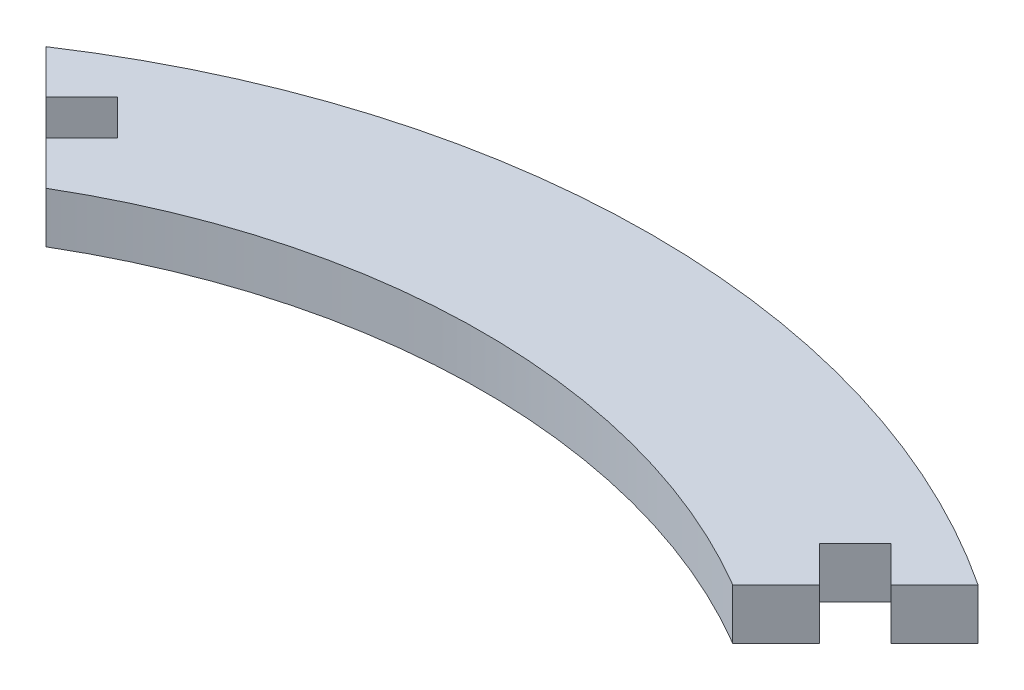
from build123d import *

# Parameters (mm, degrees)
SALIENTE_EXTRUIR1_DEPTH = 3
CORTAR_EXTRUIR1_DEPTH   = 3


with BuildPart() as part:
    # Croquis1 → Saliente-Extruir1 (new body)
    with BuildSketch(Plane(origin=(0, 0, 0), x_dir=(1, 0, 0), z_dir=(0, 1, 0))):
        with BuildLine():
            Line((-27.56994834, 41.712083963), (-20.315060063, 34.457195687))
            ThreePointArc((-20.315060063, 34.457195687), (0, 40), (20.315060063, 34.457195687))
            Line((20.315060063, 34.457195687), (27.56994834, 41.712083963))
            ThreePointArc((27.56994834, 41.712083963), (0, 50), (-27.56994834, 41.712083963))
        make_face()
    extrude(amount=SALIENTE_EXTRUIR1_DEPTH)

    # Croquis3 → Cortar-Extruir1 (cut)
    with BuildSketch(Plane(origin=(0, 3, 0), x_dir=(1, 0, 0), z_dir=(0, 1, 0))):
        Polygon((22.88184403, 37.023979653), (20.760523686, 39.145299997), (22.88184403, 41.266620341), (25.003164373, 39.145299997), align=None)
        Polygon((-25.003164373, 39.145299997), (-22.88184403, 37.023979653), (-20.760523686, 39.145299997), (-22.88184403, 41.266620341), align=None)
    extrude(amount=-CORTAR_EXTRUIR1_DEPTH, mode=Mode.SUBTRACT)


solid = part.part
